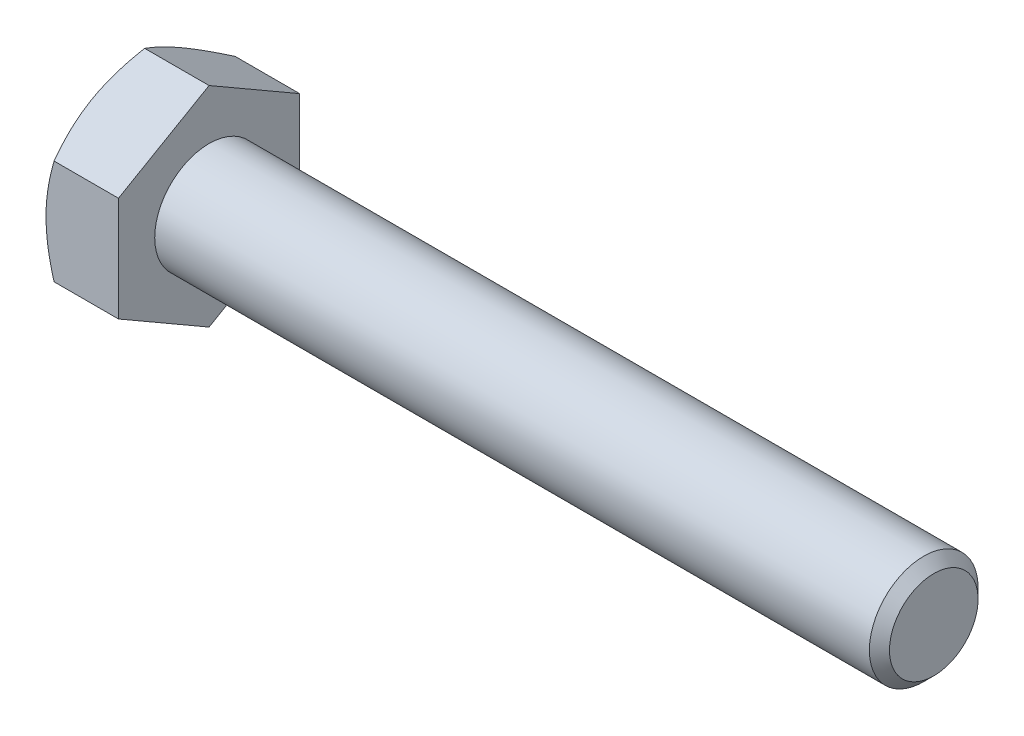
ISO-10303-21;
HEADER;
FILE_DESCRIPTION(('STEP AP214'),'2;1');
FILE_NAME('part.step','',(''),(''),'','','');
FILE_SCHEMA(('AUTOMOTIVE_DESIGN { 1 0 10303 214 1 1 1 1 }'));
ENDSEC;
DATA;
#1=APPLICATION_CONTEXT('core data for automotive mechanical design processes');
#2=APPLICATION_PROTOCOL_DEFINITION('international standard','automotive_design',2000,#1);
#3=PRODUCT_CONTEXT('',#1,'mechanical');
#4=PRODUCT('Part','Part','',(#3));
#5=PRODUCT_RELATED_PRODUCT_CATEGORY('part','',(#4));
#6=PRODUCT_DEFINITION_FORMATION('','',#4);
#7=PRODUCT_DEFINITION_CONTEXT('part definition',#1,'design');
#8=PRODUCT_DEFINITION('design','',#6,#7);
#9=PRODUCT_DEFINITION_SHAPE('','',#8);
#10=(LENGTH_UNIT() NAMED_UNIT(*) SI_UNIT(.MILLI.,.METRE.));
#11=(NAMED_UNIT(*) PLANE_ANGLE_UNIT() SI_UNIT($,.RADIAN.));
#12=(NAMED_UNIT(*) SI_UNIT($,.STERADIAN.) SOLID_ANGLE_UNIT());
#13=UNCERTAINTY_MEASURE_WITH_UNIT(LENGTH_MEASURE(1.E-05),#10,'distance_accuracy_value','');
#14=(GEOMETRIC_REPRESENTATION_CONTEXT(3) GLOBAL_UNCERTAINTY_ASSIGNED_CONTEXT((#13)) GLOBAL_UNIT_ASSIGNED_CONTEXT((#10,
#11,#12)) REPRESENTATION_CONTEXT('',''));
#15=CARTESIAN_POINT('',(0.,0.,0.));
#16=DIRECTION('',(0.,0.,1.));
#17=DIRECTION('',(1.,0.,0.));
#18=AXIS2_PLACEMENT_3D('',#15,#16,#17);
#19=CARTESIAN_POINT('',(4.,2.88675134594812,-5.));
#20=DIRECTION('',(0.,-0.866025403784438,0.500000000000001));
#21=DIRECTION('',(0.,-0.500000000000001,-0.866025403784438));
#22=AXIS2_PLACEMENT_3D('',#19,#20,#21);
#23=PLANE('',#22);
#24=CARTESIAN_POINT('',(0.446648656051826,5.7736181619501,0.000199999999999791));
#25=CARTESIAN_POINT('',(0.373386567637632,5.64675433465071,-0.219534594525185));
#26=CARTESIAN_POINT('',(0.30675132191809,5.5188054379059,-0.44114858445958));
#27=CARTESIAN_POINT('',(0.19043899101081,5.26069210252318,-0.888213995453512));
#28=CARTESIAN_POINT('',(0.140803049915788,5.13052307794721,-1.11367335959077));
#29=CARTESIAN_POINT('',(0.0635510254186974,4.87177839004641,-1.56183230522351));
#30=CARTESIAN_POINT('',(0.0354203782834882,4.74324302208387,-1.78446209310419));
#31=CARTESIAN_POINT('',(0.0101949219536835,4.54998783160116,-2.11918990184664));
#32=CARTESIAN_POINT('',(0.00461345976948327,4.48552534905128,-2.23084219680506));
#33=CARTESIAN_POINT('',(-0.000797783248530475,4.35654081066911,-2.45424997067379));
#34=CARTESIAN_POINT('',(-0.000627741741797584,4.2920187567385,-2.56600544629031));
#35=CARTESIAN_POINT('',(0.00775363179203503,4.11524635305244,-2.87218423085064));
#36=CARTESIAN_POINT('',(0.0218297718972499,4.00305457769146,-3.06650608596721));
#37=CARTESIAN_POINT('',(0.0664652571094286,3.77941563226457,-3.4538601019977));
#38=CARTESIAN_POINT('',(0.0970398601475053,3.66796924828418,-3.64689090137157));
#39=CARTESIAN_POINT('',(0.17346849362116,3.44387972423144,-4.03502534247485));
#40=CARTESIAN_POINT('',(0.219646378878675,3.3312648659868,-4.23007999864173));
#41=CARTESIAN_POINT('',(0.324451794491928,3.1077146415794,-4.61728034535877));
#42=CARTESIAN_POINT('',(0.383054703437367,2.99677641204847,-4.80943099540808));
#43=CARTESIAN_POINT('',(0.446648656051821,2.88663587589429,-5.0002));
#44=B_SPLINE_CURVE_WITH_KNOTS('',3,(#24,#25,#26,#27,#28,#29,#30,#31,#32,#33,#34,#35,#36,#37,#38,
#39,#40,#41,#42,#43),.UNSPECIFIED.,.F.,.F.,(4,2,2,2,2,2,2,2,2,4),(0.,0.79255584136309,
1.58701660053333,2.3618153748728,2.74884076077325,3.13585419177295,3.80962362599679,
4.48401723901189,5.17336882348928,5.86136694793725),.UNSPECIFIED.);
#45=CARTESIAN_POINT('',(0.4465819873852,5.77350269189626,0.));
#46=VERTEX_POINT('',#45);
#47=CARTESIAN_POINT('',(0.,4.33012701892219,-2.50000000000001));
#48=VERTEX_POINT('',#47);
#49=EDGE_CURVE('E55',#46,#48,#44,.T.);
#50=ORIENTED_EDGE('',*,*,#49,.F.);
#51=DIRECTION('',(-1.,0.,0.));
#52=VECTOR('',#51,1.);
#53=CARTESIAN_POINT('',(4.,5.77350269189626,0.));
#54=LINE('',#53,#52);
#55=CARTESIAN_POINT('',(4.,5.77350269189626,0.));
#56=VERTEX_POINT('',#55);
#57=EDGE_CURVE('E151',#56,#46,#54,.T.);
#58=ORIENTED_EDGE('',*,*,#57,.F.);
#59=DIRECTION('',(0.,0.500000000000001,0.866025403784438));
#60=VECTOR('',#59,1.);
#61=CARTESIAN_POINT('',(4.,2.88675134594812,-5.));
#62=LINE('',#61,#60);
#63=CARTESIAN_POINT('',(4.,2.88675134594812,-5.));
#64=VERTEX_POINT('',#63);
#65=EDGE_CURVE('E236',#64,#56,#62,.T.);
#66=ORIENTED_EDGE('',*,*,#65,.F.);
#67=DIRECTION('',(-1.,0.,0.));
#68=VECTOR('',#67,1.);
#69=CARTESIAN_POINT('',(4.,2.88675134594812,-5.));
#70=LINE('',#69,#68);
#71=CARTESIAN_POINT('',(0.446581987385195,2.88675134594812,-5.));
#72=VERTEX_POINT('',#71);
#73=EDGE_CURVE('E139',#64,#72,#70,.T.);
#74=ORIENTED_EDGE('',*,*,#73,.T.);
#75=EDGE_CURVE('E133',#48,#72,#44,.T.);
#76=ORIENTED_EDGE('',*,*,#75,.F.);
#77=EDGE_LOOP('',(#50,#58,#66,#74,#76));
#78=FACE_BOUND('',#77,.T.);
#79=ADVANCED_FACE('F39',(#78),#23,.F.);
#80=CARTESIAN_POINT('',(4.,5.77350269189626,0.));
#81=DIRECTION('',(0.,-0.866025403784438,-0.500000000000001));
#82=DIRECTION('',(0.,0.500000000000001,-0.866025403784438));
#83=AXIS2_PLACEMENT_3D('',#80,#81,#82);
#84=PLANE('',#83);
#85=CARTESIAN_POINT('',(0.446648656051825,2.88663587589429,5.0002));
#86=CARTESIAN_POINT('',(0.373386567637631,3.01349970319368,4.78046540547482));
#87=CARTESIAN_POINT('',(0.306751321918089,3.14144859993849,4.55885141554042));
#88=CARTESIAN_POINT('',(0.190438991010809,3.3995619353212,4.11178600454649));
#89=CARTESIAN_POINT('',(0.140803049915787,3.52973095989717,3.88632664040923));
#90=CARTESIAN_POINT('',(0.0635510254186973,3.78847564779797,3.43816769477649));
#91=CARTESIAN_POINT('',(0.0354203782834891,3.91701101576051,3.21553790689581));
#92=CARTESIAN_POINT('',(0.0101949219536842,4.11026620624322,2.88081009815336));
#93=CARTESIAN_POINT('',(0.00461345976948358,4.1747286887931,2.76915780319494));
#94=CARTESIAN_POINT('',(-0.000797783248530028,4.30371322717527,2.54575002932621));
#95=CARTESIAN_POINT('',(-0.000627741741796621,4.36823528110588,2.43399455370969));
#96=CARTESIAN_POINT('',(0.0077536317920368,4.54500768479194,2.12781576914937));
#97=CARTESIAN_POINT('',(0.0218297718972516,4.65719946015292,1.93349391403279));
#98=CARTESIAN_POINT('',(0.0664652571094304,4.88083840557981,1.5461398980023));
#99=CARTESIAN_POINT('',(0.0970398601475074,4.9922847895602,1.35310909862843));
#100=CARTESIAN_POINT('',(0.173468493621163,5.21637431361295,0.964974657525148));
#101=CARTESIAN_POINT('',(0.219646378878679,5.32898917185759,0.769920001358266));
#102=CARTESIAN_POINT('',(0.324451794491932,5.55253939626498,0.382719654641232));
#103=CARTESIAN_POINT('',(0.383054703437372,5.66347762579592,0.190569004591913));
#104=CARTESIAN_POINT('',(0.446648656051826,5.7736181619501,-0.000199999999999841));
#105=B_SPLINE_CURVE_WITH_KNOTS('',3,(#85,#86,#87,#88,#89,#90,#91,#92,#93,#94,#95,#96,#97,#98,
#99,#100,#101,#102,#103,#104),.UNSPECIFIED.,.F.,.F.,(4,2,2,2,2,2,2,2,2,4),(0.,0.79255584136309,
1.58701660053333,2.3618153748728,2.74884076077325,3.13585419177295,3.80962362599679,
4.48401723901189,5.17336882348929,5.86136694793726),.UNSPECIFIED.);
#106=CARTESIAN_POINT('',(0.446581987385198,2.88675134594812,5.));
#107=VERTEX_POINT('',#106);
#108=CARTESIAN_POINT('',(0.,4.33012701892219,2.5));
#109=VERTEX_POINT('',#108);
#110=EDGE_CURVE('E62',#107,#109,#105,.T.);
#111=ORIENTED_EDGE('',*,*,#110,.F.);
#112=DIRECTION('',(-1.,0.,0.));
#113=VECTOR('',#112,1.);
#114=CARTESIAN_POINT('',(4.,2.88675134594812,5.));
#115=LINE('',#114,#113);
#116=CARTESIAN_POINT('',(4.,2.88675134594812,5.));
#117=VERTEX_POINT('',#116);
#118=EDGE_CURVE('E149',#117,#107,#115,.T.);
#119=ORIENTED_EDGE('',*,*,#118,.F.);
#120=DIRECTION('',(0.,-0.500000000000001,0.866025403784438));
#121=VECTOR('',#120,1.);
#122=CARTESIAN_POINT('',(4.,5.77350269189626,0.));
#123=LINE('',#122,#121);
#124=EDGE_CURVE('E234',#56,#117,#123,.T.);
#125=ORIENTED_EDGE('',*,*,#124,.F.);
#126=ORIENTED_EDGE('',*,*,#57,.T.);
#127=EDGE_CURVE('E166',#109,#46,#105,.T.);
#128=ORIENTED_EDGE('',*,*,#127,.F.);
#129=EDGE_LOOP('',(#111,#119,#125,#126,#128));
#130=FACE_BOUND('',#129,.T.);
#131=ADVANCED_FACE('F172',(#130),#84,.F.);
#132=CARTESIAN_POINT('',(4.,2.88675134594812,5.));
#133=DIRECTION('',(0.,0.,-1.));
#134=DIRECTION('',(0.,1.,0.));
#135=AXIS2_PLACEMENT_3D('',#132,#133,#134);
#136=PLANE('',#135);
#137=CARTESIAN_POINT('',(2.47533544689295,-7.82661640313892,5.));
#138=CARTESIAN_POINT('',(2.36879683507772,-7.60758613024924,5.));
#139=CARTESIAN_POINT('',(2.26325911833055,-7.38806071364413,5.));
#140=CARTESIAN_POINT('',(2.0547470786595,-6.94775649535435,5.));
#141=CARTESIAN_POINT('',(1.95177314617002,-6.7269775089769,5.));
#142=CARTESIAN_POINT('',(1.74844778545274,-6.28280027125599,5.));
#143=CARTESIAN_POINT('',(1.64811306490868,-6.05939434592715,5.));
#144=CARTESIAN_POINT('',(1.45145486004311,-5.61083043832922,5.));
#145=CARTESIAN_POINT('',(1.35513119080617,-5.38567253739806,5.));
#146=CARTESIAN_POINT('',(1.1644503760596,-4.92576614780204,5.));
#147=CARTESIAN_POINT('',(1.07026351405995,-4.69094667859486,5.));
#148=CARTESIAN_POINT('',(0.888844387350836,-4.21858752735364,5.));
#149=CARTESIAN_POINT('',(0.801612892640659,-3.98104754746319,5.));
#150=CARTESIAN_POINT('',(0.63634107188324,-3.50329086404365,5.));
#151=CARTESIAN_POINT('',(0.558282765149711,-3.26308044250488,5.));
#152=CARTESIAN_POINT('',(0.413813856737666,-2.77921467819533,5.));
#153=CARTESIAN_POINT('',(0.347399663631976,-2.53556042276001,5.));
#154=CARTESIAN_POINT('',(0.229707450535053,-2.04600448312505,5.));
#155=CARTESIAN_POINT('',(0.17834657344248,-1.80012308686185,5.));
#156=CARTESIAN_POINT('',(0.093623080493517,-1.30522837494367,5.));
#157=CARTESIAN_POINT('',(0.0602585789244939,-1.05621539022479,5.));
#158=CARTESIAN_POINT('',(0.0146229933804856,-0.559584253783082,5.));
#159=CARTESIAN_POINT('',(0.00207498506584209,-0.311992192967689,5.));
#160=CARTESIAN_POINT('',(-0.00159747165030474,0.183375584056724,5.));
#161=CARTESIAN_POINT('',(0.00727849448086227,0.431151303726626,5.));
#162=CARTESIAN_POINT('',(0.0397265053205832,0.849622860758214,5.));
#163=CARTESIAN_POINT('',(0.0579847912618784,1.02075746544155,5.));
#164=CARTESIAN_POINT('',(0.103624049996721,1.36181398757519,5.));
#165=CARTESIAN_POINT('',(0.131006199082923,1.5317357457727,5.));
#166=CARTESIAN_POINT('',(0.22540333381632,2.03942834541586,5.));
#167=CARTESIAN_POINT('',(0.304653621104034,2.37495177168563,5.));
#168=CARTESIAN_POINT('',(0.442611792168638,2.87686006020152,5.));
#169=CARTESIAN_POINT('',(0.492453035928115,3.04583048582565,5.));
#170=CARTESIAN_POINT('',(0.597441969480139,3.38213061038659,5.));
#171=CARTESIAN_POINT('',(0.652589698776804,3.5494602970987,5.));
#172=CARTESIAN_POINT('',(0.767295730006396,3.88253122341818,5.));
#173=CARTESIAN_POINT('',(0.826852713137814,4.04827292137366,5.));
#174=CARTESIAN_POINT('',(0.94966349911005,4.37837269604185,5.));
#175=CARTESIAN_POINT('',(1.01291722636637,4.54273080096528,5.));
#176=CARTESIAN_POINT('',(1.18384085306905,4.97467594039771,5.));
#177=CARTESIAN_POINT('',(1.29410564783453,5.2412350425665,5.));
#178=CARTESIAN_POINT('',(1.52085041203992,5.77170603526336,5.));
#179=CARTESIAN_POINT('',(1.63733099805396,6.0356176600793,5.));
#180=CARTESIAN_POINT('',(1.87507624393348,6.56138078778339,5.));
#181=CARTESIAN_POINT('',(1.99634255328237,6.82323154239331,5.));
#182=CARTESIAN_POINT('',(2.24254703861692,7.34518395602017,5.));
#183=CARTESIAN_POINT('',(2.36748508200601,7.60528567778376,5.));
#184=CARTESIAN_POINT('',(2.62044102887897,8.12446478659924,5.));
#185=CARTESIAN_POINT('',(2.74846325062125,8.38354006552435,5.));
#186=CARTESIAN_POINT('',(3.00682668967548,8.90053291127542,5.));
#187=CARTESIAN_POINT('',(3.13716793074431,9.15845046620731,5.));
#188=CARTESIAN_POINT('',(3.53092424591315,9.93067662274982,5.));
#189=CARTESIAN_POINT('',(3.79712405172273,10.4435647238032,5.00000000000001));
#190=CARTESIAN_POINT('',(4.30724046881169,11.4147548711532,5.00000000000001));
#191=CARTESIAN_POINT('',(4.55067498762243,11.873311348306,5.00000000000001));
#192=CARTESIAN_POINT('',(5.04052915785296,12.7888590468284,5.00000000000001));
#193=CARTESIAN_POINT('',(5.28694897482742,13.2458501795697,5.00000000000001));
#194=CARTESIAN_POINT('',(5.78122505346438,14.1571829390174,5.00000000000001));
#195=CARTESIAN_POINT('',(6.02907430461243,14.6115283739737,5.00000000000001));
#196=CARTESIAN_POINT('',(6.52648185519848,15.5192398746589,5.00000000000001));
#197=CARTESIAN_POINT('',(6.77604002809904,15.9726060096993,5.00000000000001));
#198=CARTESIAN_POINT('',(7.02622264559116,16.4256251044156,5.00000000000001));
#199=B_SPLINE_CURVE_WITH_KNOTS('',3,(#137,#138,#139,#140,#141,#142,#143,#144,#145,#146,#147,
#148,#149,#150,#151,#152,#153,#154,#155,#156,#157,#158,#159,#160,#161,#162,#163,#164,#165,#166,
#167,#168,#169,#170,#171,#172,#173,#174,#175,#176,#177,#178,#179,#180,#181,#182,#183,#184,#185,
#186,#187,#188,#189,#190,#191,#192,#193,#194,#195,#196,#197,#198),.UNSPECIFIED.,.F.,.F.,(4,2,2,
2,2,2,2,2,2,2,2,2,2,2,2,2,2,2,2,2,2,2,2,2,2,2,2,2,2,2,4),(0.,0.730708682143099,1.46152797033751,
2.19620403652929,2.93084619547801,3.68977491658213,4.44878753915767,5.20628666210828,
5.9635517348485,6.71656679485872,7.46950293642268,8.212339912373,8.95519126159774,
9.4712599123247,9.98739512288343,11.0201893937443,11.5486465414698,12.0771076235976,
12.6054112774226,13.1337041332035,13.9989833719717,14.864348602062,15.7300147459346,
16.5956496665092,17.4625765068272,18.3295122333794,20.0630293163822,21.6205191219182,
23.1780956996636,24.7307447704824,26.2832800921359),.UNSPECIFIED.);
#200=CARTESIAN_POINT('',(0.446581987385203,-2.88675134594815,5.));
#201=VERTEX_POINT('',#200);
#202=CARTESIAN_POINT('',(0.,0.,5.));
#203=VERTEX_POINT('',#202);
#204=EDGE_CURVE('E246',#201,#203,#199,.T.);
#205=ORIENTED_EDGE('',*,*,#204,.F.);
#206=DIRECTION('',(-1.,0.,0.));
#207=VECTOR('',#206,1.);
#208=CARTESIAN_POINT('',(4.,-2.88675134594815,5.));
#209=LINE('',#208,#207);
#210=CARTESIAN_POINT('',(4.,-2.88675134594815,5.));
#211=VERTEX_POINT('',#210);
#212=EDGE_CURVE('E141',#211,#201,#209,.T.);
#213=ORIENTED_EDGE('',*,*,#212,.F.);
#214=DIRECTION('',(0.,-1.,0.));
#215=VECTOR('',#214,1.);
#216=CARTESIAN_POINT('',(4.,2.88675134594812,5.));
#217=LINE('',#216,#215);
#218=EDGE_CURVE('E230',#117,#211,#217,.T.);
#219=ORIENTED_EDGE('',*,*,#218,.F.);
#220=ORIENTED_EDGE('',*,*,#118,.T.);
#221=EDGE_CURVE('E188',#203,#107,#199,.T.);
#222=ORIENTED_EDGE('',*,*,#221,.F.);
#223=EDGE_LOOP('',(#205,#213,#219,#220,#222));
#224=FACE_BOUND('',#223,.T.);
#225=ADVANCED_FACE('F252',(#224),#136,.F.);
#226=CARTESIAN_POINT('',(4.,-5.77350269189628,0.));
#227=DIRECTION('',(0.,0.866025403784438,-0.500000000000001));
#228=DIRECTION('',(0.,0.500000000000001,0.866025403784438));
#229=AXIS2_PLACEMENT_3D('',#226,#227,#228);
#230=PLANE('',#229);
#231=CARTESIAN_POINT('',(0.44664865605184,-5.77361816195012,-0.000199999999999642));
#232=CARTESIAN_POINT('',(0.373386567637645,-5.64675433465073,0.219534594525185));
#233=CARTESIAN_POINT('',(0.306751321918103,-5.51880543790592,0.441148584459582));
#234=CARTESIAN_POINT('',(0.190438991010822,-5.2606921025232,0.888213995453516));
#235=CARTESIAN_POINT('',(0.1408030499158,-5.13052307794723,1.11367335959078));
#236=CARTESIAN_POINT('',(0.0635510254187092,-4.87177839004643,1.56183230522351));
#237=CARTESIAN_POINT('',(0.0354203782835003,-4.74324302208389,1.7844620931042));
#238=CARTESIAN_POINT('',(0.0101949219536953,-4.54998783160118,2.11918990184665));
#239=CARTESIAN_POINT('',(0.00461345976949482,-4.4855253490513,2.23084219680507));
#240=CARTESIAN_POINT('',(-0.000797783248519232,-4.35654081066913,2.45424997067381));
#241=CARTESIAN_POINT('',(-0.00062774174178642,-4.29201875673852,2.56600544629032));
#242=CARTESIAN_POINT('',(0.0077536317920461,-4.11524635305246,2.87218423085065));
#243=CARTESIAN_POINT('',(0.021829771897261,-4.00305457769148,3.06650608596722));
#244=CARTESIAN_POINT('',(0.0664652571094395,-3.77941563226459,3.45386010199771));
#245=CARTESIAN_POINT('',(0.0970398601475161,-3.6679692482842,3.64689090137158));
#246=CARTESIAN_POINT('',(0.17346849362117,-3.44387972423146,4.03502534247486));
#247=CARTESIAN_POINT('',(0.219646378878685,-3.33126486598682,4.23007999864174));
#248=CARTESIAN_POINT('',(0.324451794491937,-3.10771464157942,4.61728034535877));
#249=CARTESIAN_POINT('',(0.383054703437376,-2.99677641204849,4.80943099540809));
#250=CARTESIAN_POINT('',(0.446648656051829,-2.88663587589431,5.0002));
#251=B_SPLINE_CURVE_WITH_KNOTS('',3,(#231,#232,#233,#234,#235,#236,#237,#238,#239,#240,#241,
#242,#243,#244,#245,#246,#247,#248,#249,#250),.UNSPECIFIED.,.F.,.F.,(4,2,2,2,2,2,2,2,2,4),(0.,
0.792555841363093,1.58701660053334,2.36181537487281,2.74884076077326,3.13585419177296,
3.8096236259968,4.4840172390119,5.17336882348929,5.86136694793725),.UNSPECIFIED.);
#252=CARTESIAN_POINT('',(0.446581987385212,-5.77350269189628,0.));
#253=VERTEX_POINT('',#252);
#254=CARTESIAN_POINT('',(0.,-4.33012701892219,2.50000000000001));
#255=VERTEX_POINT('',#254);
#256=EDGE_CURVE('E174',#253,#255,#251,.T.);
#257=ORIENTED_EDGE('',*,*,#256,.F.);
#258=DIRECTION('',(-1.,0.,0.));
#259=VECTOR('',#258,1.);
#260=CARTESIAN_POINT('',(4.,-5.77350269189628,0.));
#261=LINE('',#260,#259);
#262=CARTESIAN_POINT('',(4.,-5.77350269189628,0.));
#263=VERTEX_POINT('',#262);
#264=EDGE_CURVE('E138',#263,#253,#261,.T.);
#265=ORIENTED_EDGE('',*,*,#264,.F.);
#266=DIRECTION('',(0.,-0.500000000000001,-0.866025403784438));
#267=VECTOR('',#266,1.);
#268=CARTESIAN_POINT('',(4.,-5.77350269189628,0.));
#269=LINE('',#268,#267);
#270=EDGE_CURVE('E228',#211,#263,#269,.T.);
#271=ORIENTED_EDGE('',*,*,#270,.F.);
#272=ORIENTED_EDGE('',*,*,#212,.T.);
#273=EDGE_CURVE('E176',#255,#201,#251,.T.);
#274=ORIENTED_EDGE('',*,*,#273,.F.);
#275=EDGE_LOOP('',(#257,#265,#271,#272,#274));
#276=FACE_BOUND('',#275,.T.);
#277=ADVANCED_FACE('F224',(#276),#230,.F.);
#278=CARTESIAN_POINT('',(4.,-2.88675134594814,-5.));
#279=DIRECTION('',(0.,0.866025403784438,0.500000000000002));
#280=DIRECTION('',(0.,-0.500000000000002,0.866025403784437));
#281=AXIS2_PLACEMENT_3D('',#278,#279,#280);
#282=PLANE('',#281);
#283=CARTESIAN_POINT('',(0.446648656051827,-2.8866358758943,-5.0002));
#284=CARTESIAN_POINT('',(0.373386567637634,-3.01349970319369,-4.78046540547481));
#285=CARTESIAN_POINT('',(0.306751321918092,-3.1414485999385,-4.55885141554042));
#286=CARTESIAN_POINT('',(0.190438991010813,-3.39956193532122,-4.11178600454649));
#287=CARTESIAN_POINT('',(0.140803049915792,-3.52973095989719,-3.88632664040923));
#288=CARTESIAN_POINT('',(0.0635510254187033,-3.78847564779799,-3.43816769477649));
#289=CARTESIAN_POINT('',(0.0354203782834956,-3.91701101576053,-3.21553790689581));
#290=CARTESIAN_POINT('',(0.0101949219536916,-4.11026620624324,-2.88081009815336));
#291=CARTESIAN_POINT('',(0.00461345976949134,-4.17472868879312,-2.76915780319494));
#292=CARTESIAN_POINT('',(-0.000797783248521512,-4.30371322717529,-2.5457500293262));
#293=CARTESIAN_POINT('',(-0.000627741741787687,-4.36823528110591,-2.43399455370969));
#294=CARTESIAN_POINT('',(0.00775363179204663,-4.54500768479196,-2.12781576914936));
#295=CARTESIAN_POINT('',(0.0218297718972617,-4.65719946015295,-1.93349391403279));
#296=CARTESIAN_POINT('',(0.0664652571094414,-4.88083840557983,-1.54613989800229));
#297=CARTESIAN_POINT('',(0.0970398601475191,-4.99228478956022,-1.35310909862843));
#298=CARTESIAN_POINT('',(0.173468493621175,-5.21637431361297,-0.964974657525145));
#299=CARTESIAN_POINT('',(0.219646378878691,-5.32898917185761,-0.769920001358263));
#300=CARTESIAN_POINT('',(0.324451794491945,-5.55253939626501,-0.382719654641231));
#301=CARTESIAN_POINT('',(0.383054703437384,-5.66347762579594,-0.190569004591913));
#302=CARTESIAN_POINT('',(0.446648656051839,-5.77361816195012,0.00020000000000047));
#303=B_SPLINE_CURVE_WITH_KNOTS('',3,(#283,#284,#285,#286,#287,#288,#289,#290,#291,#292,#293,
#294,#295,#296,#297,#298,#299,#300,#301,#302),.UNSPECIFIED.,.F.,.F.,(4,2,2,2,2,2,2,2,2,4),(0.,
0.792555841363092,1.58701660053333,2.36181537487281,2.74884076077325,3.13585419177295,
3.80962362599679,4.4840172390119,5.17336882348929,5.86136694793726),.UNSPECIFIED.);
#304=CARTESIAN_POINT('',(0.446581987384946,-2.88675134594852,-5.));
#305=VERTEX_POINT('',#304);
#306=CARTESIAN_POINT('',(0.,-4.33012701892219,-2.50000000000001));
#307=VERTEX_POINT('',#306);
#308=EDGE_CURVE('E115',#305,#307,#303,.T.);
#309=ORIENTED_EDGE('',*,*,#308,.F.);
#310=DIRECTION('',(-1.,0.,0.));
#311=VECTOR('',#310,1.);
#312=CARTESIAN_POINT('',(4.,-2.88675134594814,-5.));
#313=LINE('',#312,#311);
#314=CARTESIAN_POINT('',(4.,-2.88675134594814,-5.));
#315=VERTEX_POINT('',#314);
#316=EDGE_CURVE('E129',#315,#305,#313,.T.);
#317=ORIENTED_EDGE('',*,*,#316,.F.);
#318=DIRECTION('',(0.,0.500000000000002,-0.866025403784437));
#319=VECTOR('',#318,1.);
#320=CARTESIAN_POINT('',(4.,-2.88675134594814,-5.));
#321=LINE('',#320,#319);
#322=EDGE_CURVE('E226',#263,#315,#321,.T.);
#323=ORIENTED_EDGE('',*,*,#322,.F.);
#324=ORIENTED_EDGE('',*,*,#264,.T.);
#325=EDGE_CURVE('E132',#307,#253,#303,.T.);
#326=ORIENTED_EDGE('',*,*,#325,.F.);
#327=EDGE_LOOP('',(#309,#317,#323,#324,#326));
#328=FACE_BOUND('',#327,.T.);
#329=ADVANCED_FACE('F127',(#328),#282,.F.);
#330=CARTESIAN_POINT('',(4.,2.88675134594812,-5.));
#331=DIRECTION('',(0.,0.,1.));
#332=DIRECTION('',(0.,-1.,0.));
#333=AXIS2_PLACEMENT_3D('',#330,#331,#332);
#334=PLANE('',#333);
#335=CARTESIAN_POINT('',(2.47533544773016,-7.82661640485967,-5.));
#336=CARTESIAN_POINT('',(2.36879683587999,-7.60758613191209,-5.));
#337=CARTESIAN_POINT('',(2.26325911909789,-7.38806071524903,-5.));
#338=CARTESIAN_POINT('',(2.05474707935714,-6.9477564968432,-5.));
#339=CARTESIAN_POINT('',(1.9517731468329,-6.72697751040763,-5.));
#340=CARTESIAN_POINT('',(1.74844778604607,-6.28280027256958,-5.));
#341=CARTESIAN_POINT('',(1.64811306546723,-6.05939434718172,-5.));
#342=CARTESIAN_POINT('',(1.45145486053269,-5.61083043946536,-5.));
#343=CARTESIAN_POINT('',(1.35513119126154,-5.38567253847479,-5.));
#344=CARTESIAN_POINT('',(1.16445037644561,-4.92576614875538,-5.));
#345=CARTESIAN_POINT('',(1.07026351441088,-4.69094667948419,-5.));
#346=CARTESIAN_POINT('',(0.888844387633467,-4.21858752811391,-5.));
#347=CARTESIAN_POINT('',(0.801612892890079,-3.98104754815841,-5.));
#348=CARTESIAN_POINT('',(0.636341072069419,-3.50329086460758,-5.));
#349=CARTESIAN_POINT('',(0.55828276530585,-3.26308044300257,-5.));
#350=CARTESIAN_POINT('',(0.413813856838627,-2.77921467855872,-5.));
#351=CARTESIAN_POINT('',(0.347399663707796,-2.53556042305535,-5.));
#352=CARTESIAN_POINT('',(0.229707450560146,-2.04600448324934,-5.));
#353=CARTESIAN_POINT('',(0.178346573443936,-1.80012308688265,-5.));
#354=CARTESIAN_POINT('',(0.093623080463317,-1.305228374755,-5.));
#355=CARTESIAN_POINT('',(0.0602585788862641,-1.05621538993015,-5.));
#356=CARTESIAN_POINT('',(0.0146229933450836,-0.55958425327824,-5.));
#357=CARTESIAN_POINT('',(0.00207498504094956,-0.311992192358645,-5.));
#358=CARTESIAN_POINT('',(-0.00159747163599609,0.183375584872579,-5.));
#359=CARTESIAN_POINT('',(0.00727849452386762,0.43115130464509,-5.));
#360=CARTESIAN_POINT('',(0.0397265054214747,0.849622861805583,-5.));
#361=CARTESIAN_POINT('',(0.0579847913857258,1.02075746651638,-5.));
#362=CARTESIAN_POINT('',(0.103624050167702,1.3618139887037,-5.));
#363=CARTESIAN_POINT('',(0.131006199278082,1.53173574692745,-5.));
#364=CARTESIAN_POINT('',(0.225403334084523,2.03942834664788,-5.));
#365=CARTESIAN_POINT('',(0.304653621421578,2.37495177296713,-5.));
#366=CARTESIAN_POINT('',(0.442611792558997,2.87686006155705,-5.));
#367=CARTESIAN_POINT('',(0.492453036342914,3.04583048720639,-5.));
#368=CARTESIAN_POINT('',(0.597441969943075,3.38213061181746,-5.));
#369=CARTESIAN_POINT('',(0.652589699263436,3.54946029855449,-5.));
#370=CARTESIAN_POINT('',(0.767295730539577,3.88253122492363,-5.));
#371=CARTESIAN_POINT('',(0.826852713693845,4.04827292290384,-5.));
#372=CARTESIAN_POINT('',(0.949663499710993,4.37837269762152,-5.));
#373=CARTESIAN_POINT('',(1.01291722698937,4.54273080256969,-5.));
#374=CARTESIAN_POINT('',(1.18384085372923,4.97467594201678,-5.));
#375=CARTESIAN_POINT('',(1.29410564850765,5.24123504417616,-5.));
#376=CARTESIAN_POINT('',(1.5208504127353,5.77170603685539,-5.));
#377=CARTESIAN_POINT('',(1.63733099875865,6.03561766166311,-5.));
#378=CARTESIAN_POINT('',(1.87507624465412,6.56138078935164,-5.));
#379=CARTESIAN_POINT('',(1.99634255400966,6.82323154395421,-5.));
#380=CARTESIAN_POINT('',(2.2425470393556,7.34518395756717,-5.));
#381=CARTESIAN_POINT('',(2.36748508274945,7.6052856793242,-5.));
#382=CARTESIAN_POINT('',(2.62044102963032,8.12446478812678,-5.));
#383=CARTESIAN_POINT('',(2.74846325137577,8.38354006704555,-5.));
#384=CARTESIAN_POINT('',(3.00682669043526,8.90053291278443,-5.));
#385=CARTESIAN_POINT('',(3.13716793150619,9.15845046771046,-5.));
#386=CARTESIAN_POINT('',(3.5309242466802,9.93067662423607,-5.));
#387=CARTESIAN_POINT('',(3.79712405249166,10.443564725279,-4.99999999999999));
#388=CARTESIAN_POINT('',(4.30724046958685,11.4147548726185,-4.99999999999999));
#389=CARTESIAN_POINT('',(4.55067498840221,11.8733113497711,-4.99999999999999));
#390=CARTESIAN_POINT('',(5.04052915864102,12.7888590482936,-4.99999999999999));
#391=CARTESIAN_POINT('',(5.28694897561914,13.2458501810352,-4.99999999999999));
#392=CARTESIAN_POINT('',(5.78122505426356,14.1571829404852,-4.99999999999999));
#393=CARTESIAN_POINT('',(6.02907430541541,14.6115283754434,-4.99999999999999));
#394=CARTESIAN_POINT('',(6.52648185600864,15.519239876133,-4.99999999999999));
#395=CARTESIAN_POINT('',(6.77604002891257,15.9726060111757,-4.99999999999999));
#396=CARTESIAN_POINT('',(7.02622264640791,16.4256251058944,-4.99999999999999));
#397=B_SPLINE_CURVE_WITH_KNOTS('',3,(#335,#336,#337,#338,#339,#340,#341,#342,#343,#344,#345,
#346,#347,#348,#349,#350,#351,#352,#353,#354,#355,#356,#357,#358,#359,#360,#361,#362,#363,#364,
#365,#366,#367,#368,#369,#370,#371,#372,#373,#374,#375,#376,#377,#378,#379,#380,#381,#382,#383,
#384,#385,#386,#387,#388,#389,#390,#391,#392,#393,#394,#395,#396),.UNSPECIFIED.,.F.,.F.,(4,2,2,
2,2,2,2,2,2,2,2,2,2,2,2,2,2,2,2,2,2,2,2,2,2,2,2,2,2,2,4),(0.,0.730708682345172,1.46152797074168,
2.19620403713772,2.93084619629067,3.6897749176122,4.4487875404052,5.20628666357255,
5.96355173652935,6.71656679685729,7.4695029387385,8.21233991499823,8.95519126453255,
9.4712599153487,9.98739512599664,11.0201893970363,11.5486465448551,12.0771076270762,
12.6054112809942,13.1337041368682,13.9989833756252,14.8643486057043,15.7300147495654,
16.5956496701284,17.4625765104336,18.329512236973,20.0630293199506,21.6205191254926,
23.178095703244,24.7307447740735,26.2832800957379),.UNSPECIFIED.);
#398=CARTESIAN_POINT('',(0.,0.,-5.));
#399=VERTEX_POINT('',#398);
#400=EDGE_CURVE('E121',#72,#399,#397,.F.);
#401=ORIENTED_EDGE('',*,*,#400,.F.);
#402=ORIENTED_EDGE('',*,*,#73,.F.);
#403=DIRECTION('',(0.,1.,0.));
#404=VECTOR('',#403,1.);
#405=CARTESIAN_POINT('',(4.,2.88675134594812,-5.));
#406=LINE('',#405,#404);
#407=EDGE_CURVE('E137',#315,#64,#406,.T.);
#408=ORIENTED_EDGE('',*,*,#407,.F.);
#409=ORIENTED_EDGE('',*,*,#316,.T.);
#410=EDGE_CURVE('E112',#399,#305,#397,.F.);
#411=ORIENTED_EDGE('',*,*,#410,.F.);
#412=EDGE_LOOP('',(#401,#402,#408,#409,#411));
#413=FACE_BOUND('',#412,.T.);
#414=ADVANCED_FACE('F135',(#413),#334,.F.);
#415=CARTESIAN_POINT('',(4.,0.,-9.99999999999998));
#416=DIRECTION('',(1.,0.,0.));
#417=DIRECTION('',(0.,0.,-1.));
#418=AXIS2_PLACEMENT_3D('',#415,#416,#417);
#419=PLANE('',#418);
#420=ORIENTED_EDGE('',*,*,#65,.T.);
#421=ORIENTED_EDGE('',*,*,#124,.T.);
#422=ORIENTED_EDGE('',*,*,#218,.T.);
#423=ORIENTED_EDGE('',*,*,#270,.T.);
#424=ORIENTED_EDGE('',*,*,#322,.T.);
#425=ORIENTED_EDGE('',*,*,#407,.T.);
#426=EDGE_LOOP('',(#420,#421,#422,#423,#424,#425));
#427=FACE_BOUND('',#426,.T.);
#428=CARTESIAN_POINT('',(4.,0.,0.));
#429=DIRECTION('',(1.,0.,0.));
#430=DIRECTION('',(0.,0.,-1.));
#431=AXIS2_PLACEMENT_3D('',#428,#429,#430);
#432=CIRCLE('',#431,3.);
#433=CARTESIAN_POINT('',(4.,0.,-3.));
#434=VERTEX_POINT('',#433);
#435=EDGE_CURVE('E239',#434,#434,#432,.F.);
#436=ORIENTED_EDGE('',*,*,#435,.T.);
#437=EDGE_LOOP('',(#436));
#438=FACE_BOUND('',#437,.T.);
#439=ADVANCED_FACE('F254',(#427,#438),#419,.T.);
#440=CARTESIAN_POINT('',(0.,0.,0.));
#441=DIRECTION('',(-1.,0.,0.));
#442=DIRECTION('',(0.,0.,1.));
#443=AXIS2_PLACEMENT_3D('',#440,#441,#442);
#444=CYLINDRICAL_SURFACE('',#443,3.);
#445=ORIENTED_EDGE('',*,*,#435,.F.);
#446=EDGE_LOOP('',(#445));
#447=FACE_BOUND('',#446,.T.);
#448=CARTESIAN_POINT('',(43.4455,0.,0.));
#449=DIRECTION('',(-1.,0.,0.));
#450=DIRECTION('',(0.,0.,1.));
#451=AXIS2_PLACEMENT_3D('',#448,#449,#450);
#452=CIRCLE('',#451,3.);
#453=CARTESIAN_POINT('',(43.4455,0.,3.));
#454=VERTEX_POINT('',#453);
#455=EDGE_CURVE('E242',#454,#454,#452,.T.);
#456=ORIENTED_EDGE('',*,*,#455,.T.);
#457=EDGE_LOOP('',(#456));
#458=FACE_BOUND('',#457,.T.);
#459=ADVANCED_FACE('F285',(#447,#458),#444,.T.);
#460=CARTESIAN_POINT('',(44.,0.,0.));
#461=DIRECTION('',(-1.,0.,0.));
#462=DIRECTION('',(0.,0.,1.));
#463=AXIS2_PLACEMENT_3D('',#460,#461,#462);
#464=CONICAL_SURFACE('',#463,2.4455,0.785398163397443);
#465=ORIENTED_EDGE('',*,*,#455,.F.);
#466=EDGE_LOOP('',(#465));
#467=FACE_BOUND('',#466,.T.);
#468=CARTESIAN_POINT('',(44.,0.,0.));
#469=DIRECTION('',(-1.,0.,0.));
#470=DIRECTION('',(0.,0.,1.));
#471=AXIS2_PLACEMENT_3D('',#468,#469,#470);
#472=CIRCLE('',#471,2.4455);
#473=CARTESIAN_POINT('',(44.,0.,2.4455));
#474=VERTEX_POINT('',#473);
#475=EDGE_CURVE('E244',#474,#474,#472,.T.);
#476=ORIENTED_EDGE('',*,*,#475,.T.);
#477=EDGE_LOOP('',(#476));
#478=FACE_BOUND('',#477,.T.);
#479=ADVANCED_FACE('F288',(#467,#478),#464,.T.);
#480=CARTESIAN_POINT('',(44.,0.,0.));
#481=DIRECTION('',(-1.,0.,0.));
#482=DIRECTION('',(0.,0.,1.));
#483=AXIS2_PLACEMENT_3D('',#480,#481,#482);
#484=PLANE('',#483);
#485=ORIENTED_EDGE('',*,*,#475,.F.);
#486=EDGE_LOOP('',(#485));
#487=FACE_BOUND('',#486,.T.);
#488=ADVANCED_FACE('F201',(#487),#484,.F.);
#489=CARTESIAN_POINT('',(0.,0.,0.));
#490=DIRECTION('',(1.,0.,0.));
#491=DIRECTION('',(0.,0.,-1.));
#492=AXIS2_PLACEMENT_3D('',#489,#490,#491);
#493=CONICAL_SURFACE('',#492,5.,1.0471975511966);
#494=ORIENTED_EDGE('',*,*,#308,.T.);
#495=CARTESIAN_POINT('',(0.,0.,0.));
#496=DIRECTION('',(1.,0.,0.));
#497=DIRECTION('',(0.,0.,-1.));
#498=AXIS2_PLACEMENT_3D('',#495,#496,#497);
#499=CIRCLE('',#498,5.);
#500=EDGE_CURVE('E43',#307,#399,#499,.T.);
#501=ORIENTED_EDGE('',*,*,#500,.T.);
#502=ORIENTED_EDGE('',*,*,#410,.T.);
#503=EDGE_LOOP('',(#494,#501,#502));
#504=FACE_BOUND('',#503,.T.);
#505=ADVANCED_FACE('F114',(#504),#493,.T.);
#506=ORIENTED_EDGE('',*,*,#256,.T.);
#507=EDGE_CURVE('E156',#255,#307,#499,.T.);
#508=ORIENTED_EDGE('',*,*,#507,.T.);
#509=ORIENTED_EDGE('',*,*,#325,.T.);
#510=EDGE_LOOP('',(#506,#508,#509));
#511=FACE_BOUND('',#510,.T.);
#512=ADVANCED_FACE('F200',(#511),#493,.T.);
#513=ORIENTED_EDGE('',*,*,#204,.T.);
#514=EDGE_CURVE('E157',#203,#255,#499,.T.);
#515=ORIENTED_EDGE('',*,*,#514,.T.);
#516=ORIENTED_EDGE('',*,*,#273,.T.);
#517=EDGE_LOOP('',(#513,#515,#516));
#518=FACE_BOUND('',#517,.T.);
#519=ADVANCED_FACE('F195',(#518),#493,.T.);
#520=ORIENTED_EDGE('',*,*,#221,.T.);
#521=ORIENTED_EDGE('',*,*,#110,.T.);
#522=CARTESIAN_POINT('',(0.,0.,0.));
#523=DIRECTION('',(-1.,0.,0.));
#524=DIRECTION('',(0.,0.,1.));
#525=AXIS2_PLACEMENT_3D('',#522,#523,#524);
#526=CIRCLE('',#525,5.);
#527=EDGE_CURVE('E122',#203,#109,#526,.T.);
#528=ORIENTED_EDGE('',*,*,#527,.F.);
#529=EDGE_LOOP('',(#520,#521,#528));
#530=FACE_BOUND('',#529,.T.);
#531=ADVANCED_FACE('F199',(#530),#493,.T.);
#532=ORIENTED_EDGE('',*,*,#127,.T.);
#533=ORIENTED_EDGE('',*,*,#49,.T.);
#534=EDGE_CURVE('E48',#48,#109,#499,.T.);
#535=ORIENTED_EDGE('',*,*,#534,.T.);
#536=EDGE_LOOP('',(#532,#533,#535));
#537=FACE_BOUND('',#536,.T.);
#538=ADVANCED_FACE('F165',(#537),#493,.T.);
#539=ORIENTED_EDGE('',*,*,#75,.T.);
#540=ORIENTED_EDGE('',*,*,#400,.T.);
#541=EDGE_CURVE('E11',#399,#48,#499,.T.);
#542=ORIENTED_EDGE('',*,*,#541,.T.);
#543=EDGE_LOOP('',(#539,#540,#542));
#544=FACE_BOUND('',#543,.T.);
#545=ADVANCED_FACE('F258',(#544),#493,.T.);
#546=CARTESIAN_POINT('',(0.,0.,-9.99999999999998));
#547=DIRECTION('',(1.,0.,0.));
#548=DIRECTION('',(0.,0.,-1.));
#549=AXIS2_PLACEMENT_3D('',#546,#547,#548);
#550=PLANE('',#549);
#551=ORIENTED_EDGE('',*,*,#541,.F.);
#552=ORIENTED_EDGE('',*,*,#500,.F.);
#553=ORIENTED_EDGE('',*,*,#507,.F.);
#554=ORIENTED_EDGE('',*,*,#514,.F.);
#555=ORIENTED_EDGE('',*,*,#527,.T.);
#556=ORIENTED_EDGE('',*,*,#534,.F.);
#557=EDGE_LOOP('',(#551,#552,#553,#554,#555,#556));
#558=FACE_BOUND('',#557,.T.);
#559=ADVANCED_FACE('F169',(#558),#550,.F.);
#560=CLOSED_SHELL('',(#79,#131,#225,#277,#329,#414,#439,#459,#479,#488,#505,#512,#519,#531,#538,
#545,#559));
#561=MANIFOLD_SOLID_BREP('B2',#560);
#562=ADVANCED_BREP_SHAPE_REPRESENTATION('',(#18,#561),#14);
#563=SHAPE_DEFINITION_REPRESENTATION(#9,#562);
ENDSEC;
END-ISO-10303-21;
